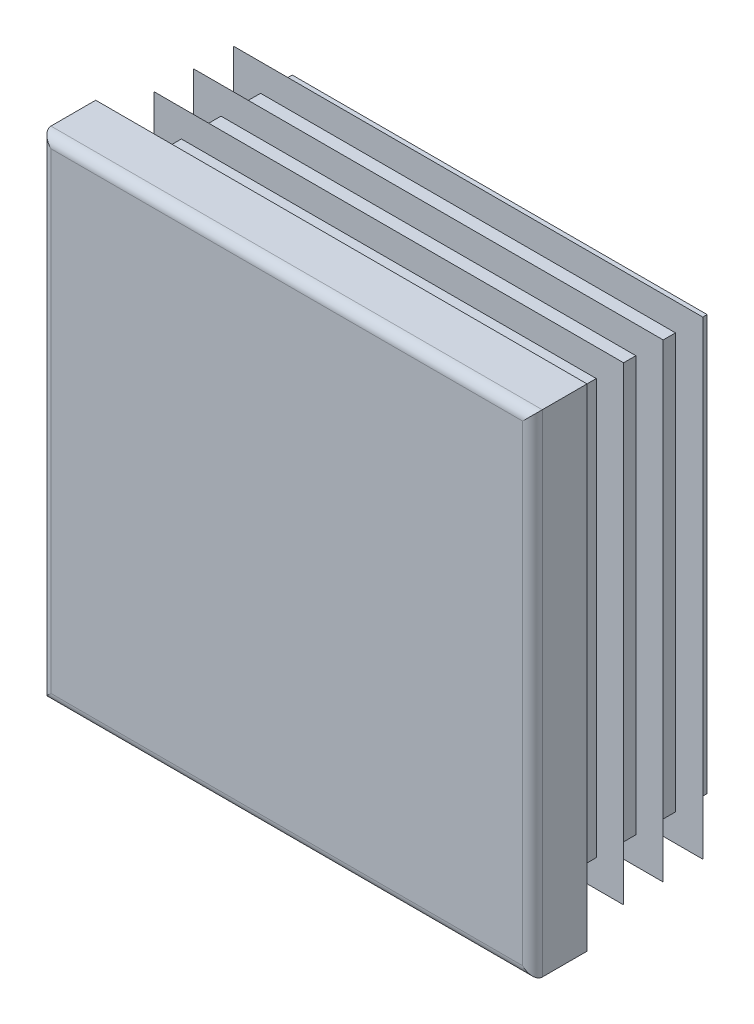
ISO-10303-21;
HEADER;
FILE_DESCRIPTION(('STEP AP214'),'2;1');
FILE_NAME('part.step','',(''),(''),'','','');
FILE_SCHEMA(('AUTOMOTIVE_DESIGN { 1 0 10303 214 1 1 1 1 }'));
ENDSEC;
DATA;
#1=APPLICATION_CONTEXT('core data for automotive mechanical design processes');
#2=APPLICATION_PROTOCOL_DEFINITION('international standard','automotive_design',2000,#1);
#3=PRODUCT_CONTEXT('',#1,'mechanical');
#4=PRODUCT('Part','Part','',(#3));
#5=PRODUCT_RELATED_PRODUCT_CATEGORY('part','',(#4));
#6=PRODUCT_DEFINITION_FORMATION('','',#4);
#7=PRODUCT_DEFINITION_CONTEXT('part definition',#1,'design');
#8=PRODUCT_DEFINITION('design','',#6,#7);
#9=PRODUCT_DEFINITION_SHAPE('','',#8);
#10=(LENGTH_UNIT() NAMED_UNIT(*) SI_UNIT(.MILLI.,.METRE.));
#11=(NAMED_UNIT(*) PLANE_ANGLE_UNIT() SI_UNIT($,.RADIAN.));
#12=(NAMED_UNIT(*) SI_UNIT($,.STERADIAN.) SOLID_ANGLE_UNIT());
#13=UNCERTAINTY_MEASURE_WITH_UNIT(LENGTH_MEASURE(1.E-05),#10,'distance_accuracy_value','');
#14=(GEOMETRIC_REPRESENTATION_CONTEXT(3) GLOBAL_UNCERTAINTY_ASSIGNED_CONTEXT((#13)) GLOBAL_UNIT_ASSIGNED_CONTEXT((#10,
#11,#12)) REPRESENTATION_CONTEXT('',''));
#15=CARTESIAN_POINT('',(0.,0.,0.));
#16=DIRECTION('',(0.,0.,1.));
#17=DIRECTION('',(1.,0.,0.));
#18=AXIS2_PLACEMENT_3D('',#15,#16,#17);
#19=CARTESIAN_POINT('',(21.6,-22.5,5.));
#20=DIRECTION('',(0.,0.,-1.));
#21=DIRECTION('',(0.,1.,0.));
#22=AXIS2_PLACEMENT_3D('',#19,#20,#21);
#23=PLANE('',#22);
#24=DIRECTION('',(0.,1.,0.));
#25=VECTOR('',#24,1.);
#26=CARTESIAN_POINT('',(-21.6,-22.5,5.));
#27=LINE('',#26,#25);
#28=CARTESIAN_POINT('',(-21.6,-21.6,5.));
#29=VERTEX_POINT('',#28);
#30=CARTESIAN_POINT('',(-21.6,21.6,5.));
#31=VERTEX_POINT('',#30);
#32=EDGE_CURVE('E262',#29,#31,#27,.T.);
#33=ORIENTED_EDGE('',*,*,#32,.F.);
#34=DIRECTION('',(-1.,0.,0.));
#35=VECTOR('',#34,1.);
#36=CARTESIAN_POINT('',(22.5,-21.6,5.));
#37=LINE('',#36,#35);
#38=CARTESIAN_POINT('',(21.6,-21.6,5.));
#39=VERTEX_POINT('',#38);
#40=EDGE_CURVE('E432',#39,#29,#37,.T.);
#41=ORIENTED_EDGE('',*,*,#40,.F.);
#42=DIRECTION('',(0.,1.,0.));
#43=VECTOR('',#42,1.);
#44=CARTESIAN_POINT('',(21.6,-22.5,5.));
#45=LINE('',#44,#43);
#46=CARTESIAN_POINT('',(21.6,21.6,5.));
#47=VERTEX_POINT('',#46);
#48=EDGE_CURVE('E257',#39,#47,#45,.T.);
#49=ORIENTED_EDGE('',*,*,#48,.T.);
#50=DIRECTION('',(-1.,0.,0.));
#51=VECTOR('',#50,1.);
#52=CARTESIAN_POINT('',(22.5,21.6,5.));
#53=LINE('',#52,#51);
#54=EDGE_CURVE('E534',#47,#31,#53,.T.);
#55=ORIENTED_EDGE('',*,*,#54,.T.);
#56=EDGE_LOOP('',(#33,#41,#49,#55));
#57=FACE_BOUND('',#56,.T.);
#58=ADVANCED_FACE('F14',(#57),#23,.F.);
#59=CARTESIAN_POINT('',(-21.6,-22.5,4.1));
#60=DIRECTION('',(0.,1.,0.));
#61=DIRECTION('',(-1.,0.,0.));
#62=AXIS2_PLACEMENT_3D('',#59,#60,#61);
#63=CYLINDRICAL_SURFACE('',#62,0.9);
#64=DIRECTION('',(0.,1.,0.));
#65=VECTOR('',#64,1.);
#66=CARTESIAN_POINT('',(-22.5,-22.5,4.1));
#67=LINE('',#66,#65);
#68=CARTESIAN_POINT('',(-22.5,-22.5,4.1));
#69=VERTEX_POINT('',#68);
#70=CARTESIAN_POINT('',(-22.5,22.5,4.1));
#71=VERTEX_POINT('',#70);
#72=EDGE_CURVE('E354',#69,#71,#67,.T.);
#73=ORIENTED_EDGE('',*,*,#72,.F.);
#74=CARTESIAN_POINT('',(-21.6,-21.6,4.1));
#75=DIRECTION('',(-0.707106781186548,0.707106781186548,0.));
#76=DIRECTION('',(0.707106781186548,0.707106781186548,0.));
#77=AXIS2_PLACEMENT_3D('',#74,#75,#76);
#78=ELLIPSE('',#77,1.27279220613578,0.9);
#79=EDGE_CURVE('E59',#69,#29,#78,.T.);
#80=ORIENTED_EDGE('',*,*,#79,.T.);
#81=ORIENTED_EDGE('',*,*,#32,.T.);
#82=CARTESIAN_POINT('',(-21.6,21.6,4.1));
#83=DIRECTION('',(0.707106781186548,0.707106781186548,0.));
#84=DIRECTION('',(-0.707106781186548,0.707106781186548,0.));
#85=AXIS2_PLACEMENT_3D('',#82,#83,#84);
#86=ELLIPSE('',#85,1.27279220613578,0.9);
#87=EDGE_CURVE('E258',#31,#71,#86,.F.);
#88=ORIENTED_EDGE('',*,*,#87,.T.);
#89=EDGE_LOOP('',(#73,#80,#81,#88));
#90=FACE_BOUND('',#89,.T.);
#91=ADVANCED_FACE('F16',(#90),#63,.T.);
#92=CARTESIAN_POINT('',(-22.5,-22.5,4.1));
#93=DIRECTION('',(1.,0.,0.));
#94=DIRECTION('',(0.,1.,0.));
#95=AXIS2_PLACEMENT_3D('',#92,#93,#94);
#96=PLANE('',#95);
#97=DIRECTION('',(0.,0.,-1.));
#98=VECTOR('',#97,1.);
#99=CARTESIAN_POINT('',(-22.5,22.5,4.1));
#100=LINE('',#99,#98);
#101=CARTESIAN_POINT('',(-22.5,22.5,0.));
#102=VERTEX_POINT('',#101);
#103=EDGE_CURVE('E519',#71,#102,#100,.T.);
#104=ORIENTED_EDGE('',*,*,#103,.T.);
#105=DIRECTION('',(0.,1.,0.));
#106=VECTOR('',#105,1.);
#107=CARTESIAN_POINT('',(-22.5,-22.5,0.));
#108=LINE('',#107,#106);
#109=CARTESIAN_POINT('',(-22.5,-22.5,0.));
#110=VERTEX_POINT('',#109);
#111=EDGE_CURVE('E352',#110,#102,#108,.T.);
#112=ORIENTED_EDGE('',*,*,#111,.F.);
#113=DIRECTION('',(0.,0.,-1.));
#114=VECTOR('',#113,1.);
#115=CARTESIAN_POINT('',(-22.5,-22.5,4.1));
#116=LINE('',#115,#114);
#117=EDGE_CURVE('E520',#69,#110,#116,.T.);
#118=ORIENTED_EDGE('',*,*,#117,.F.);
#119=ORIENTED_EDGE('',*,*,#72,.T.);
#120=EDGE_LOOP('',(#104,#112,#118,#119));
#121=FACE_BOUND('',#120,.T.);
#122=ADVANCED_FACE('F604',(#121),#96,.F.);
#123=CARTESIAN_POINT('',(-19.,-22.5,0.));
#124=DIRECTION('',(1.,0.,0.));
#125=DIRECTION('',(0.,1.,0.));
#126=AXIS2_PLACEMENT_3D('',#123,#124,#125);
#127=PLANE('',#126);
#128=DIRECTION('',(0.,1.,0.));
#129=VECTOR('',#128,1.);
#130=CARTESIAN_POINT('',(-19.,-22.5,0.));
#131=LINE('',#130,#129);
#132=CARTESIAN_POINT('',(-19.,-19.,0.));
#133=VERTEX_POINT('',#132);
#134=CARTESIAN_POINT('',(-19.,19.,0.));
#135=VERTEX_POINT('',#134);
#136=EDGE_CURVE('E349',#133,#135,#131,.T.);
#137=ORIENTED_EDGE('',*,*,#136,.T.);
#138=DIRECTION('',(0.,0.,-1.));
#139=VECTOR('',#138,1.);
#140=CARTESIAN_POINT('',(-19.,19.,0.));
#141=LINE('',#140,#139);
#142=CARTESIAN_POINT('',(-19.,19.,-0.725));
#143=VERTEX_POINT('',#142);
#144=EDGE_CURVE('E445',#135,#143,#141,.T.);
#145=ORIENTED_EDGE('',*,*,#144,.T.);
#146=DIRECTION('',(0.,1.,0.));
#147=VECTOR('',#146,1.);
#148=CARTESIAN_POINT('',(-19.,-22.5,-0.725));
#149=LINE('',#148,#147);
#150=CARTESIAN_POINT('',(-19.,-19.,-0.725));
#151=VERTEX_POINT('',#150);
#152=EDGE_CURVE('E346',#151,#143,#149,.T.);
#153=ORIENTED_EDGE('',*,*,#152,.F.);
#154=DIRECTION('',(0.,0.,1.));
#155=VECTOR('',#154,1.);
#156=CARTESIAN_POINT('',(-19.,-19.,0.));
#157=LINE('',#156,#155);
#158=EDGE_CURVE('E439',#151,#133,#157,.T.);
#159=ORIENTED_EDGE('',*,*,#158,.T.);
#160=EDGE_LOOP('',(#137,#145,#153,#159));
#161=FACE_BOUND('',#160,.T.);
#162=ADVANCED_FACE('F728',(#161),#127,.F.);
#163=CARTESIAN_POINT('',(-21.5,-22.5,-0.725));
#164=DIRECTION('',(0.573576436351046,0.,0.819152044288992));
#165=DIRECTION('',(-0.819152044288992,0.,0.573576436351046));
#166=AXIS2_PLACEMENT_3D('',#163,#164,#165);
#167=PLANE('',#166);
#168=DIRECTION('',(0.,1.,0.));
#169=VECTOR('',#168,1.);
#170=CARTESIAN_POINT('',(-21.5,-22.5,-0.725));
#171=LINE('',#170,#169);
#172=CARTESIAN_POINT('',(-21.5,-21.5,-0.725));
#173=VERTEX_POINT('',#172);
#174=CARTESIAN_POINT('',(-21.5,21.5,-0.725));
#175=VERTEX_POINT('',#174);
#176=EDGE_CURVE('E344',#173,#175,#171,.T.);
#177=ORIENTED_EDGE('',*,*,#176,.T.);
#178=DIRECTION('',(0.633687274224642,-0.633687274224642,-0.443712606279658));
#179=VECTOR('',#178,1.);
#180=CARTESIAN_POINT('',(-3.8313792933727,3.83137929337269,-13.0967014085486));
#181=LINE('',#180,#179);
#182=CARTESIAN_POINT('',(-19.,19.,-2.47551884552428));
#183=VERTEX_POINT('',#182);
#184=EDGE_CURVE('E457',#175,#183,#181,.T.);
#185=ORIENTED_EDGE('',*,*,#184,.T.);
#186=DIRECTION('',(0.,1.,0.));
#187=VECTOR('',#186,1.);
#188=CARTESIAN_POINT('',(-19.,-22.5,-2.47551884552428));
#189=LINE('',#188,#187);
#190=CARTESIAN_POINT('',(-19.,-19.,-2.47551884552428));
#191=VERTEX_POINT('',#190);
#192=EDGE_CURVE('E341',#191,#183,#189,.T.);
#193=ORIENTED_EDGE('',*,*,#192,.F.);
#194=DIRECTION('',(-0.633687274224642,-0.633687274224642,0.443712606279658));
#195=VECTOR('',#194,1.);
#196=CARTESIAN_POINT('',(-21.9015595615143,-21.9015595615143,-0.44382496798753));
#197=LINE('',#196,#195);
#198=EDGE_CURVE('E451',#191,#173,#197,.T.);
#199=ORIENTED_EDGE('',*,*,#198,.T.);
#200=EDGE_LOOP('',(#177,#185,#193,#199));
#201=FACE_BOUND('',#200,.T.);
#202=ADVANCED_FACE('F732',(#201),#167,.F.);
#203=CARTESIAN_POINT('',(-19.,-22.5,-2.47551884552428));
#204=DIRECTION('',(1.,0.,0.));
#205=DIRECTION('',(0.,1.,0.));
#206=AXIS2_PLACEMENT_3D('',#203,#204,#205);
#207=PLANE('',#206);
#208=ORIENTED_EDGE('',*,*,#192,.T.);
#209=DIRECTION('',(0.,0.,-1.));
#210=VECTOR('',#209,1.);
#211=CARTESIAN_POINT('',(-19.,19.,-2.47551884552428));
#212=LINE('',#211,#210);
#213=CARTESIAN_POINT('',(-19.,19.,-4.35));
#214=VERTEX_POINT('',#213);
#215=EDGE_CURVE('E463',#183,#214,#212,.T.);
#216=ORIENTED_EDGE('',*,*,#215,.T.);
#217=DIRECTION('',(0.,1.,0.));
#218=VECTOR('',#217,1.);
#219=CARTESIAN_POINT('',(-19.,-22.5,-4.35));
#220=LINE('',#219,#218);
#221=CARTESIAN_POINT('',(-19.,-19.,-4.35));
#222=VERTEX_POINT('',#221);
#223=EDGE_CURVE('E338',#222,#214,#220,.T.);
#224=ORIENTED_EDGE('',*,*,#223,.F.);
#225=DIRECTION('',(0.,0.,1.));
#226=VECTOR('',#225,1.);
#227=CARTESIAN_POINT('',(-19.,-19.,-2.47551884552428));
#228=LINE('',#227,#226);
#229=EDGE_CURVE('E460',#222,#191,#228,.T.);
#230=ORIENTED_EDGE('',*,*,#229,.T.);
#231=EDGE_LOOP('',(#208,#216,#224,#230));
#232=FACE_BOUND('',#231,.T.);
#233=ADVANCED_FACE('F738',(#232),#207,.F.);
#234=CARTESIAN_POINT('',(-21.5,-22.5,-4.35));
#235=DIRECTION('',(0.573576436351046,0.,0.819152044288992));
#236=DIRECTION('',(-0.819152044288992,0.,0.573576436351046));
#237=AXIS2_PLACEMENT_3D('',#234,#235,#236);
#238=PLANE('',#237);
#239=DIRECTION('',(0.,1.,0.));
#240=VECTOR('',#239,1.);
#241=CARTESIAN_POINT('',(-21.5,-22.5,-4.35));
#242=LINE('',#241,#240);
#243=CARTESIAN_POINT('',(-21.5,-21.5,-4.35));
#244=VERTEX_POINT('',#243);
#245=CARTESIAN_POINT('',(-21.5,21.5,-4.35));
#246=VERTEX_POINT('',#245);
#247=EDGE_CURVE('E336',#244,#246,#242,.T.);
#248=ORIENTED_EDGE('',*,*,#247,.T.);
#249=DIRECTION('',(0.633687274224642,-0.633687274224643,-0.443712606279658));
#250=VECTOR('',#249,1.);
#251=CARTESIAN_POINT('',(-3.8313792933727,3.83137929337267,-16.7217014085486));
#252=LINE('',#251,#250);
#253=CARTESIAN_POINT('',(-19.,19.,-6.10051884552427));
#254=VERTEX_POINT('',#253);
#255=EDGE_CURVE('E475',#246,#254,#252,.T.);
#256=ORIENTED_EDGE('',*,*,#255,.T.);
#257=DIRECTION('',(0.,1.,0.));
#258=VECTOR('',#257,1.);
#259=CARTESIAN_POINT('',(-19.,-22.5,-6.10051884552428));
#260=LINE('',#259,#258);
#261=CARTESIAN_POINT('',(-19.,-19.,-6.10051884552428));
#262=VERTEX_POINT('',#261);
#263=EDGE_CURVE('E333',#262,#254,#260,.T.);
#264=ORIENTED_EDGE('',*,*,#263,.F.);
#265=DIRECTION('',(-0.633687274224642,-0.633687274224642,0.443712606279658));
#266=VECTOR('',#265,1.);
#267=CARTESIAN_POINT('',(-21.9015595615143,-21.9015595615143,-4.06882496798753));
#268=LINE('',#267,#266);
#269=EDGE_CURVE('E469',#262,#244,#268,.T.);
#270=ORIENTED_EDGE('',*,*,#269,.T.);
#271=EDGE_LOOP('',(#248,#256,#264,#270));
#272=FACE_BOUND('',#271,.T.);
#273=ADVANCED_FACE('F742',(#272),#238,.F.);
#274=CARTESIAN_POINT('',(-19.,-22.5,-6.10051884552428));
#275=DIRECTION('',(1.,0.,0.));
#276=DIRECTION('',(0.,1.,0.));
#277=AXIS2_PLACEMENT_3D('',#274,#275,#276);
#278=PLANE('',#277);
#279=ORIENTED_EDGE('',*,*,#263,.T.);
#280=DIRECTION('',(0.,0.,-1.));
#281=VECTOR('',#280,1.);
#282=CARTESIAN_POINT('',(-19.,19.,-6.10051884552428));
#283=LINE('',#282,#281);
#284=CARTESIAN_POINT('',(-19.,19.,-7.975));
#285=VERTEX_POINT('',#284);
#286=EDGE_CURVE('E481',#254,#285,#283,.T.);
#287=ORIENTED_EDGE('',*,*,#286,.T.);
#288=DIRECTION('',(0.,1.,0.));
#289=VECTOR('',#288,1.);
#290=CARTESIAN_POINT('',(-19.,-22.5,-7.975));
#291=LINE('',#290,#289);
#292=CARTESIAN_POINT('',(-19.,-19.,-7.975));
#293=VERTEX_POINT('',#292);
#294=EDGE_CURVE('E330',#293,#285,#291,.T.);
#295=ORIENTED_EDGE('',*,*,#294,.F.);
#296=DIRECTION('',(0.,0.,1.));
#297=VECTOR('',#296,1.);
#298=CARTESIAN_POINT('',(-19.,-19.,-6.10051884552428));
#299=LINE('',#298,#297);
#300=EDGE_CURVE('E478',#293,#262,#299,.T.);
#301=ORIENTED_EDGE('',*,*,#300,.T.);
#302=EDGE_LOOP('',(#279,#287,#295,#301));
#303=FACE_BOUND('',#302,.T.);
#304=ADVANCED_FACE('F746',(#303),#278,.F.);
#305=CARTESIAN_POINT('',(-21.5,-22.5,-7.975));
#306=DIRECTION('',(0.573576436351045,0.,0.819152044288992));
#307=DIRECTION('',(-0.819152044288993,0.,0.573576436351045));
#308=AXIS2_PLACEMENT_3D('',#305,#306,#307);
#309=PLANE('',#308);
#310=DIRECTION('',(0.,1.,0.));
#311=VECTOR('',#310,1.);
#312=CARTESIAN_POINT('',(-21.5,-22.5,-7.975));
#313=LINE('',#312,#311);
#314=CARTESIAN_POINT('',(-21.5,-21.5,-7.975));
#315=VERTEX_POINT('',#314);
#316=CARTESIAN_POINT('',(-21.5,21.5,-7.975));
#317=VERTEX_POINT('',#316);
#318=EDGE_CURVE('E328',#315,#317,#313,.T.);
#319=ORIENTED_EDGE('',*,*,#318,.T.);
#320=DIRECTION('',(0.633687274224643,-0.633687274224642,-0.443712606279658));
#321=VECTOR('',#320,1.);
#322=CARTESIAN_POINT('',(-3.8313792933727,3.83137929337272,-20.3467014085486));
#323=LINE('',#322,#321);
#324=CARTESIAN_POINT('',(-19.,19.,-9.72551884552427));
#325=VERTEX_POINT('',#324);
#326=EDGE_CURVE('E493',#317,#325,#323,.T.);
#327=ORIENTED_EDGE('',*,*,#326,.T.);
#328=DIRECTION('',(0.,1.,0.));
#329=VECTOR('',#328,1.);
#330=CARTESIAN_POINT('',(-19.,-22.5,-9.72551884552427));
#331=LINE('',#330,#329);
#332=CARTESIAN_POINT('',(-19.,-19.,-9.72551884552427));
#333=VERTEX_POINT('',#332);
#334=EDGE_CURVE('E325',#333,#325,#331,.T.);
#335=ORIENTED_EDGE('',*,*,#334,.F.);
#336=DIRECTION('',(-0.633687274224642,-0.633687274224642,0.443712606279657));
#337=VECTOR('',#336,1.);
#338=CARTESIAN_POINT('',(-21.9015595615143,-21.9015595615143,-7.69382496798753));
#339=LINE('',#338,#337);
#340=EDGE_CURVE('E487',#333,#315,#339,.T.);
#341=ORIENTED_EDGE('',*,*,#340,.T.);
#342=EDGE_LOOP('',(#319,#327,#335,#341));
#343=FACE_BOUND('',#342,.T.);
#344=ADVANCED_FACE('F668',(#343),#309,.F.);
#345=CARTESIAN_POINT('',(-19.,-22.5,-9.72551884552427));
#346=DIRECTION('',(1.,0.,0.));
#347=DIRECTION('',(0.,1.,0.));
#348=AXIS2_PLACEMENT_3D('',#345,#346,#347);
#349=PLANE('',#348);
#350=ORIENTED_EDGE('',*,*,#334,.T.);
#351=DIRECTION('',(0.,0.,-1.));
#352=VECTOR('',#351,1.);
#353=CARTESIAN_POINT('',(-19.,19.,-9.72551884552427));
#354=LINE('',#353,#352);
#355=CARTESIAN_POINT('',(-19.,19.,-11.6));
#356=VERTEX_POINT('',#355);
#357=EDGE_CURVE('E499',#325,#356,#354,.T.);
#358=ORIENTED_EDGE('',*,*,#357,.T.);
#359=DIRECTION('',(0.,1.,0.));
#360=VECTOR('',#359,1.);
#361=CARTESIAN_POINT('',(-19.,-22.5,-11.6));
#362=LINE('',#361,#360);
#363=CARTESIAN_POINT('',(-19.,-19.,-11.6));
#364=VERTEX_POINT('',#363);
#365=EDGE_CURVE('E322',#364,#356,#362,.T.);
#366=ORIENTED_EDGE('',*,*,#365,.F.);
#367=DIRECTION('',(0.,0.,1.));
#368=VECTOR('',#367,1.);
#369=CARTESIAN_POINT('',(-19.,-19.,-9.72551884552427));
#370=LINE('',#369,#368);
#371=EDGE_CURVE('E496',#364,#333,#370,.T.);
#372=ORIENTED_EDGE('',*,*,#371,.T.);
#373=EDGE_LOOP('',(#350,#358,#366,#372));
#374=FACE_BOUND('',#373,.T.);
#375=ADVANCED_FACE('F665',(#374),#349,.F.);
#376=CARTESIAN_POINT('',(-21.5,-22.5,-11.6));
#377=DIRECTION('',(0.573576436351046,0.,0.819152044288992));
#378=DIRECTION('',(-0.819152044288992,0.,0.573576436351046));
#379=AXIS2_PLACEMENT_3D('',#376,#377,#378);
#380=PLANE('',#379);
#381=DIRECTION('',(0.,1.,0.));
#382=VECTOR('',#381,1.);
#383=CARTESIAN_POINT('',(-21.5,-22.5,-11.6));
#384=LINE('',#383,#382);
#385=CARTESIAN_POINT('',(-21.5,-21.5,-11.6));
#386=VERTEX_POINT('',#385);
#387=CARTESIAN_POINT('',(-21.5,21.5,-11.6));
#388=VERTEX_POINT('',#387);
#389=EDGE_CURVE('E320',#386,#388,#384,.T.);
#390=ORIENTED_EDGE('',*,*,#389,.T.);
#391=DIRECTION('',(0.633687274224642,-0.633687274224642,-0.443712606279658));
#392=VECTOR('',#391,1.);
#393=CARTESIAN_POINT('',(-3.83137929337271,3.8313792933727,-23.9717014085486));
#394=LINE('',#393,#392);
#395=CARTESIAN_POINT('',(-19.,19.,-13.3505188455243));
#396=VERTEX_POINT('',#395);
#397=EDGE_CURVE('E511',#388,#396,#394,.T.);
#398=ORIENTED_EDGE('',*,*,#397,.T.);
#399=DIRECTION('',(0.,1.,0.));
#400=VECTOR('',#399,1.);
#401=CARTESIAN_POINT('',(-19.,-22.5,-13.3505188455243));
#402=LINE('',#401,#400);
#403=CARTESIAN_POINT('',(-19.,-19.,-13.3505188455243));
#404=VERTEX_POINT('',#403);
#405=EDGE_CURVE('E317',#404,#396,#402,.T.);
#406=ORIENTED_EDGE('',*,*,#405,.F.);
#407=DIRECTION('',(-0.633687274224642,-0.633687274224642,0.443712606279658));
#408=VECTOR('',#407,1.);
#409=CARTESIAN_POINT('',(-21.9015595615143,-21.9015595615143,-11.3188249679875));
#410=LINE('',#409,#408);
#411=EDGE_CURVE('E505',#404,#386,#410,.T.);
#412=ORIENTED_EDGE('',*,*,#411,.T.);
#413=EDGE_LOOP('',(#390,#398,#406,#412));
#414=FACE_BOUND('',#413,.T.);
#415=ADVANCED_FACE('F580',(#414),#380,.F.);
#416=CARTESIAN_POINT('',(-19.,-22.5,-13.3505188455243));
#417=DIRECTION('',(1.,0.,0.));
#418=DIRECTION('',(0.,1.,0.));
#419=AXIS2_PLACEMENT_3D('',#416,#417,#418);
#420=PLANE('',#419);
#421=ORIENTED_EDGE('',*,*,#405,.T.);
#422=DIRECTION('',(0.,0.,-1.));
#423=VECTOR('',#422,1.);
#424=CARTESIAN_POINT('',(-19.,19.,-13.3505188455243));
#425=LINE('',#424,#423);
#426=CARTESIAN_POINT('',(-19.,19.,-14.5));
#427=VERTEX_POINT('',#426);
#428=EDGE_CURVE('E517',#396,#427,#425,.T.);
#429=ORIENTED_EDGE('',*,*,#428,.T.);
#430=DIRECTION('',(0.,1.,0.));
#431=VECTOR('',#430,1.);
#432=CARTESIAN_POINT('',(-19.,-22.5,-14.5));
#433=LINE('',#432,#431);
#434=CARTESIAN_POINT('',(-19.,-19.,-14.5));
#435=VERTEX_POINT('',#434);
#436=EDGE_CURVE('E314',#435,#427,#433,.T.);
#437=ORIENTED_EDGE('',*,*,#436,.F.);
#438=DIRECTION('',(0.,0.,1.));
#439=VECTOR('',#438,1.);
#440=CARTESIAN_POINT('',(-19.,-19.,-13.3505188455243));
#441=LINE('',#440,#439);
#442=EDGE_CURVE('E514',#435,#404,#441,.T.);
#443=ORIENTED_EDGE('',*,*,#442,.T.);
#444=EDGE_LOOP('',(#421,#429,#437,#443));
#445=FACE_BOUND('',#444,.T.);
#446=ADVANCED_FACE('F582',(#445),#420,.F.);
#447=CARTESIAN_POINT('',(-19.,-22.5,-14.5));
#448=DIRECTION('',(0.,0.,1.));
#449=DIRECTION('',(0.,-1.,0.));
#450=AXIS2_PLACEMENT_3D('',#447,#448,#449);
#451=PLANE('',#450);
#452=ORIENTED_EDGE('',*,*,#436,.T.);
#453=DIRECTION('',(-1.,0.,0.));
#454=VECTOR('',#453,1.);
#455=CARTESIAN_POINT('',(22.5,19.,-14.5));
#456=LINE('',#455,#454);
#457=CARTESIAN_POINT('',(19.,19.,-14.5));
#458=VERTEX_POINT('',#457);
#459=EDGE_CURVE('E388',#458,#427,#456,.T.);
#460=ORIENTED_EDGE('',*,*,#459,.F.);
#461=DIRECTION('',(0.,1.,0.));
#462=VECTOR('',#461,1.);
#463=CARTESIAN_POINT('',(19.,-22.5,-14.5));
#464=LINE('',#463,#462);
#465=CARTESIAN_POINT('',(19.,-19.,-14.5));
#466=VERTEX_POINT('',#465);
#467=EDGE_CURVE('E311',#466,#458,#464,.T.);
#468=ORIENTED_EDGE('',*,*,#467,.F.);
#469=DIRECTION('',(-1.,0.,0.));
#470=VECTOR('',#469,1.);
#471=CARTESIAN_POINT('',(22.5,-19.,-14.5));
#472=LINE('',#471,#470);
#473=EDGE_CURVE('E386',#466,#435,#472,.T.);
#474=ORIENTED_EDGE('',*,*,#473,.T.);
#475=EDGE_LOOP('',(#452,#460,#468,#474));
#476=FACE_BOUND('',#475,.T.);
#477=ADVANCED_FACE('F385',(#476),#451,.F.);
#478=CARTESIAN_POINT('',(19.,-22.5,-14.5));
#479=DIRECTION('',(-1.,0.,0.));
#480=DIRECTION('',(0.,-1.,0.));
#481=AXIS2_PLACEMENT_3D('',#478,#479,#480);
#482=PLANE('',#481);
#483=ORIENTED_EDGE('',*,*,#467,.T.);
#484=DIRECTION('',(0.,0.,1.));
#485=VECTOR('',#484,1.);
#486=CARTESIAN_POINT('',(19.,19.,-14.5));
#487=LINE('',#486,#485);
#488=CARTESIAN_POINT('',(19.,19.,-13.3505188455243));
#489=VERTEX_POINT('',#488);
#490=EDGE_CURVE('E9',#458,#489,#487,.T.);
#491=ORIENTED_EDGE('',*,*,#490,.T.);
#492=DIRECTION('',(0.,1.,0.));
#493=VECTOR('',#492,1.);
#494=CARTESIAN_POINT('',(19.,-22.5,-13.3505188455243));
#495=LINE('',#494,#493);
#496=CARTESIAN_POINT('',(19.,-19.,-13.3505188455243));
#497=VERTEX_POINT('',#496);
#498=EDGE_CURVE('E308',#497,#489,#495,.T.);
#499=ORIENTED_EDGE('',*,*,#498,.F.);
#500=DIRECTION('',(0.,0.,-1.));
#501=VECTOR('',#500,1.);
#502=CARTESIAN_POINT('',(19.,-19.,-14.5));
#503=LINE('',#502,#501);
#504=EDGE_CURVE('E23',#497,#466,#503,.T.);
#505=ORIENTED_EDGE('',*,*,#504,.T.);
#506=EDGE_LOOP('',(#483,#491,#499,#505));
#507=FACE_BOUND('',#506,.T.);
#508=ADVANCED_FACE('F378',(#507),#482,.F.);
#509=CARTESIAN_POINT('',(19.,-22.5,-13.3505188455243));
#510=DIRECTION('',(-0.573576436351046,0.,0.819152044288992));
#511=DIRECTION('',(-0.819152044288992,0.,-0.573576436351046));
#512=AXIS2_PLACEMENT_3D('',#509,#510,#511);
#513=PLANE('',#512);
#514=ORIENTED_EDGE('',*,*,#498,.T.);
#515=DIRECTION('',(0.633687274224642,0.633687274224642,0.443712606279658));
#516=VECTOR('',#515,1.);
#517=CARTESIAN_POINT('',(2.33527819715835,2.33527819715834,-25.0192826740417));
#518=LINE('',#517,#516);
#519=CARTESIAN_POINT('',(21.5,21.5,-11.6));
#520=VERTEX_POINT('',#519);
#521=EDGE_CURVE('E508',#489,#520,#518,.T.);
#522=ORIENTED_EDGE('',*,*,#521,.T.);
#523=DIRECTION('',(0.,1.,0.));
#524=VECTOR('',#523,1.);
#525=CARTESIAN_POINT('',(21.5,-22.5,-11.6));
#526=LINE('',#525,#524);
#527=CARTESIAN_POINT('',(21.5,-21.5,-11.6));
#528=VERTEX_POINT('',#527);
#529=EDGE_CURVE('E305',#528,#520,#526,.T.);
#530=ORIENTED_EDGE('',*,*,#529,.F.);
#531=DIRECTION('',(-0.633687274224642,0.633687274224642,-0.443712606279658));
#532=VECTOR('',#531,1.);
#533=CARTESIAN_POINT('',(20.4054584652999,-20.4054584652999,-12.3664062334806));
#534=LINE('',#533,#532);
#535=EDGE_CURVE('E502',#528,#497,#534,.T.);
#536=ORIENTED_EDGE('',*,*,#535,.T.);
#537=EDGE_LOOP('',(#514,#522,#530,#536));
#538=FACE_BOUND('',#537,.T.);
#539=ADVANCED_FACE('F588',(#538),#513,.F.);
#540=CARTESIAN_POINT('',(21.5,-22.5,-11.6));
#541=DIRECTION('',(0.,0.,-1.));
#542=DIRECTION('',(0.,1.,0.));
#543=AXIS2_PLACEMENT_3D('',#540,#541,#542);
#544=PLANE('',#543);
#545=ORIENTED_EDGE('',*,*,#529,.T.);
#546=DIRECTION('',(-1.,0.,0.));
#547=VECTOR('',#546,1.);
#548=CARTESIAN_POINT('',(22.5,21.5,-11.6));
#549=LINE('',#548,#547);
#550=EDGE_CURVE('E394',#520,#388,#549,.T.);
#551=ORIENTED_EDGE('',*,*,#550,.T.);
#552=ORIENTED_EDGE('',*,*,#389,.F.);
#553=DIRECTION('',(-1.,0.,0.));
#554=VECTOR('',#553,1.);
#555=CARTESIAN_POINT('',(22.5,-21.5,-11.6));
#556=LINE('',#555,#554);
#557=EDGE_CURVE('E401',#528,#386,#556,.T.);
#558=ORIENTED_EDGE('',*,*,#557,.F.);
#559=EDGE_LOOP('',(#545,#551,#552,#558));
#560=FACE_BOUND('',#559,.T.);
#561=ORIENTED_EDGE('',*,*,#365,.T.);
#562=DIRECTION('',(-1.,0.,0.));
#563=VECTOR('',#562,1.);
#564=CARTESIAN_POINT('',(22.5,19.,-11.6));
#565=LINE('',#564,#563);
#566=CARTESIAN_POINT('',(19.,19.,-11.6));
#567=VERTEX_POINT('',#566);
#568=EDGE_CURVE('E567',#567,#356,#565,.T.);
#569=ORIENTED_EDGE('',*,*,#568,.F.);
#570=DIRECTION('',(0.,1.,0.));
#571=VECTOR('',#570,1.);
#572=CARTESIAN_POINT('',(19.,-22.5,-11.6));
#573=LINE('',#572,#571);
#574=CARTESIAN_POINT('',(19.,-19.,-11.6));
#575=VERTEX_POINT('',#574);
#576=EDGE_CURVE('E302',#575,#567,#573,.T.);
#577=ORIENTED_EDGE('',*,*,#576,.F.);
#578=DIRECTION('',(-1.,0.,0.));
#579=VECTOR('',#578,1.);
#580=CARTESIAN_POINT('',(22.5,-19.,-11.6));
#581=LINE('',#580,#579);
#582=EDGE_CURVE('E403',#575,#364,#581,.T.);
#583=ORIENTED_EDGE('',*,*,#582,.T.);
#584=EDGE_LOOP('',(#561,#569,#577,#583));
#585=FACE_BOUND('',#584,.T.);
#586=ADVANCED_FACE('F571',(#560,#585),#544,.F.);
#587=CARTESIAN_POINT('',(19.,-22.5,-11.6));
#588=DIRECTION('',(-1.,0.,0.));
#589=DIRECTION('',(0.,-1.,0.));
#590=AXIS2_PLACEMENT_3D('',#587,#588,#589);
#591=PLANE('',#590);
#592=ORIENTED_EDGE('',*,*,#576,.T.);
#593=DIRECTION('',(0.,0.,1.));
#594=VECTOR('',#593,1.);
#595=CARTESIAN_POINT('',(19.,19.,-11.6));
#596=LINE('',#595,#594);
#597=CARTESIAN_POINT('',(19.,19.,-9.72551884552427));
#598=VERTEX_POINT('',#597);
#599=EDGE_CURVE('E372',#567,#598,#596,.T.);
#600=ORIENTED_EDGE('',*,*,#599,.T.);
#601=DIRECTION('',(0.,1.,0.));
#602=VECTOR('',#601,1.);
#603=CARTESIAN_POINT('',(19.,-22.5,-9.72551884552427));
#604=LINE('',#603,#602);
#605=CARTESIAN_POINT('',(19.,-19.,-9.72551884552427));
#606=VERTEX_POINT('',#605);
#607=EDGE_CURVE('E299',#606,#598,#604,.T.);
#608=ORIENTED_EDGE('',*,*,#607,.F.);
#609=DIRECTION('',(0.,0.,-1.));
#610=VECTOR('',#609,1.);
#611=CARTESIAN_POINT('',(19.,-19.,-11.6));
#612=LINE('',#611,#610);
#613=EDGE_CURVE('E369',#606,#575,#612,.T.);
#614=ORIENTED_EDGE('',*,*,#613,.T.);
#615=EDGE_LOOP('',(#592,#600,#608,#614));
#616=FACE_BOUND('',#615,.T.);
#617=ADVANCED_FACE('F596',(#616),#591,.F.);
#618=CARTESIAN_POINT('',(19.,-22.5,-9.72551884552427));
#619=DIRECTION('',(-0.573576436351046,0.,0.819152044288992));
#620=DIRECTION('',(-0.819152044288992,0.,-0.573576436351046));
#621=AXIS2_PLACEMENT_3D('',#618,#619,#620);
#622=PLANE('',#621);
#623=ORIENTED_EDGE('',*,*,#607,.T.);
#624=DIRECTION('',(0.633687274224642,0.633687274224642,0.443712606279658));
#625=VECTOR('',#624,1.);
#626=CARTESIAN_POINT('',(2.33527819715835,2.33527819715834,-21.3942826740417));
#627=LINE('',#626,#625);
#628=CARTESIAN_POINT('',(21.5,21.5,-7.975));
#629=VERTEX_POINT('',#628);
#630=EDGE_CURVE('E490',#598,#629,#627,.T.);
#631=ORIENTED_EDGE('',*,*,#630,.T.);
#632=DIRECTION('',(0.,1.,0.));
#633=VECTOR('',#632,1.);
#634=CARTESIAN_POINT('',(21.5,-22.5,-7.975));
#635=LINE('',#634,#633);
#636=CARTESIAN_POINT('',(21.5,-21.5,-7.975));
#637=VERTEX_POINT('',#636);
#638=EDGE_CURVE('E296',#637,#629,#635,.T.);
#639=ORIENTED_EDGE('',*,*,#638,.F.);
#640=DIRECTION('',(-0.633687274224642,0.633687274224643,-0.443712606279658));
#641=VECTOR('',#640,1.);
#642=CARTESIAN_POINT('',(20.4054584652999,-20.4054584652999,-8.74140623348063));
#643=LINE('',#642,#641);
#644=EDGE_CURVE('E484',#637,#606,#643,.T.);
#645=ORIENTED_EDGE('',*,*,#644,.T.);
#646=EDGE_LOOP('',(#623,#631,#639,#645));
#647=FACE_BOUND('',#646,.T.);
#648=ADVANCED_FACE('F648',(#647),#622,.F.);
#649=CARTESIAN_POINT('',(21.5,-22.5,-7.975));
#650=DIRECTION('',(0.,0.,-1.));
#651=DIRECTION('',(0.,1.,0.));
#652=AXIS2_PLACEMENT_3D('',#649,#650,#651);
#653=PLANE('',#652);
#654=ORIENTED_EDGE('',*,*,#638,.T.);
#655=DIRECTION('',(-1.,0.,0.));
#656=VECTOR('',#655,1.);
#657=CARTESIAN_POINT('',(22.5,21.5,-7.975));
#658=LINE('',#657,#656);
#659=EDGE_CURVE('E561',#629,#317,#658,.T.);
#660=ORIENTED_EDGE('',*,*,#659,.T.);
#661=ORIENTED_EDGE('',*,*,#318,.F.);
#662=DIRECTION('',(-1.,0.,0.));
#663=VECTOR('',#662,1.);
#664=CARTESIAN_POINT('',(22.5,-21.5,-7.975));
#665=LINE('',#664,#663);
#666=EDGE_CURVE('E409',#637,#315,#665,.T.);
#667=ORIENTED_EDGE('',*,*,#666,.F.);
#668=EDGE_LOOP('',(#654,#660,#661,#667));
#669=FACE_BOUND('',#668,.T.);
#670=ORIENTED_EDGE('',*,*,#294,.T.);
#671=DIRECTION('',(-1.,0.,0.));
#672=VECTOR('',#671,1.);
#673=CARTESIAN_POINT('',(22.5,19.,-7.975));
#674=LINE('',#673,#672);
#675=CARTESIAN_POINT('',(19.,19.,-7.975));
#676=VERTEX_POINT('',#675);
#677=EDGE_CURVE('E559',#676,#285,#674,.T.);
#678=ORIENTED_EDGE('',*,*,#677,.F.);
#679=DIRECTION('',(0.,1.,0.));
#680=VECTOR('',#679,1.);
#681=CARTESIAN_POINT('',(19.,-22.5,-7.975));
#682=LINE('',#681,#680);
#683=CARTESIAN_POINT('',(19.,-19.,-7.975));
#684=VERTEX_POINT('',#683);
#685=EDGE_CURVE('E293',#684,#676,#682,.T.);
#686=ORIENTED_EDGE('',*,*,#685,.F.);
#687=DIRECTION('',(-1.,0.,0.));
#688=VECTOR('',#687,1.);
#689=CARTESIAN_POINT('',(22.5,-19.,-7.975));
#690=LINE('',#689,#688);
#691=EDGE_CURVE('E411',#684,#293,#690,.T.);
#692=ORIENTED_EDGE('',*,*,#691,.T.);
#693=EDGE_LOOP('',(#670,#678,#686,#692));
#694=FACE_BOUND('',#693,.T.);
#695=ADVANCED_FACE('F644',(#669,#694),#653,.F.);
#696=CARTESIAN_POINT('',(19.,-22.5,-7.975));
#697=DIRECTION('',(-1.,0.,0.));
#698=DIRECTION('',(0.,-1.,0.));
#699=AXIS2_PLACEMENT_3D('',#696,#697,#698);
#700=PLANE('',#699);
#701=ORIENTED_EDGE('',*,*,#685,.T.);
#702=DIRECTION('',(0.,0.,1.));
#703=VECTOR('',#702,1.);
#704=CARTESIAN_POINT('',(19.,19.,-7.975));
#705=LINE('',#704,#703);
#706=CARTESIAN_POINT('',(19.,19.,-6.10051884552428));
#707=VERTEX_POINT('',#706);
#708=EDGE_CURVE('E366',#676,#707,#705,.T.);
#709=ORIENTED_EDGE('',*,*,#708,.T.);
#710=DIRECTION('',(0.,1.,0.));
#711=VECTOR('',#710,1.);
#712=CARTESIAN_POINT('',(19.,-22.5,-6.10051884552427));
#713=LINE('',#712,#711);
#714=CARTESIAN_POINT('',(19.,-19.,-6.10051884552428));
#715=VERTEX_POINT('',#714);
#716=EDGE_CURVE('E290',#715,#707,#713,.T.);
#717=ORIENTED_EDGE('',*,*,#716,.F.);
#718=DIRECTION('',(0.,0.,-1.));
#719=VECTOR('',#718,1.);
#720=CARTESIAN_POINT('',(19.,-19.,-7.975));
#721=LINE('',#720,#719);
#722=EDGE_CURVE('E363',#715,#684,#721,.T.);
#723=ORIENTED_EDGE('',*,*,#722,.T.);
#724=EDGE_LOOP('',(#701,#709,#717,#723));
#725=FACE_BOUND('',#724,.T.);
#726=ADVANCED_FACE('F640',(#725),#700,.F.);
#727=CARTESIAN_POINT('',(19.,-22.5,-6.10051884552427));
#728=DIRECTION('',(-0.573576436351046,0.,0.819152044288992));
#729=DIRECTION('',(-0.819152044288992,0.,-0.573576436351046));
#730=AXIS2_PLACEMENT_3D('',#727,#728,#729);
#731=PLANE('',#730);
#732=ORIENTED_EDGE('',*,*,#716,.T.);
#733=DIRECTION('',(0.633687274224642,0.633687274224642,0.443712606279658));
#734=VECTOR('',#733,1.);
#735=CARTESIAN_POINT('',(2.33527819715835,2.33527819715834,-17.7692826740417));
#736=LINE('',#735,#734);
#737=CARTESIAN_POINT('',(21.5,21.5,-4.35));
#738=VERTEX_POINT('',#737);
#739=EDGE_CURVE('E472',#707,#738,#736,.T.);
#740=ORIENTED_EDGE('',*,*,#739,.T.);
#741=DIRECTION('',(0.,1.,0.));
#742=VECTOR('',#741,1.);
#743=CARTESIAN_POINT('',(21.5,-22.5,-4.35));
#744=LINE('',#743,#742);
#745=CARTESIAN_POINT('',(21.5,-21.5,-4.35));
#746=VERTEX_POINT('',#745);
#747=EDGE_CURVE('E287',#746,#738,#744,.T.);
#748=ORIENTED_EDGE('',*,*,#747,.F.);
#749=DIRECTION('',(-0.633687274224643,0.633687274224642,-0.443712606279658));
#750=VECTOR('',#749,1.);
#751=CARTESIAN_POINT('',(20.4054584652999,-20.4054584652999,-5.11640623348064));
#752=LINE('',#751,#750);
#753=EDGE_CURVE('E466',#746,#715,#752,.T.);
#754=ORIENTED_EDGE('',*,*,#753,.T.);
#755=EDGE_LOOP('',(#732,#740,#748,#754));
#756=FACE_BOUND('',#755,.T.);
#757=ADVANCED_FACE('F636',(#756),#731,.F.);
#758=CARTESIAN_POINT('',(21.5,-22.5,-4.35));
#759=DIRECTION('',(0.,0.,-1.));
#760=DIRECTION('',(0.,1.,0.));
#761=AXIS2_PLACEMENT_3D('',#758,#759,#760);
#762=PLANE('',#761);
#763=ORIENTED_EDGE('',*,*,#747,.T.);
#764=DIRECTION('',(-1.,0.,0.));
#765=VECTOR('',#764,1.);
#766=CARTESIAN_POINT('',(22.5,21.5,-4.35));
#767=LINE('',#766,#765);
#768=EDGE_CURVE('E553',#738,#246,#767,.T.);
#769=ORIENTED_EDGE('',*,*,#768,.T.);
#770=ORIENTED_EDGE('',*,*,#247,.F.);
#771=DIRECTION('',(-1.,0.,0.));
#772=VECTOR('',#771,1.);
#773=CARTESIAN_POINT('',(22.5,-21.5,-4.35));
#774=LINE('',#773,#772);
#775=EDGE_CURVE('E417',#746,#244,#774,.T.);
#776=ORIENTED_EDGE('',*,*,#775,.F.);
#777=EDGE_LOOP('',(#763,#769,#770,#776));
#778=FACE_BOUND('',#777,.T.);
#779=ORIENTED_EDGE('',*,*,#223,.T.);
#780=DIRECTION('',(-1.,0.,0.));
#781=VECTOR('',#780,1.);
#782=CARTESIAN_POINT('',(22.5,19.,-4.35));
#783=LINE('',#782,#781);
#784=CARTESIAN_POINT('',(19.,19.,-4.35));
#785=VERTEX_POINT('',#784);
#786=EDGE_CURVE('E551',#785,#214,#783,.T.);
#787=ORIENTED_EDGE('',*,*,#786,.F.);
#788=DIRECTION('',(0.,1.,0.));
#789=VECTOR('',#788,1.);
#790=CARTESIAN_POINT('',(19.,-22.5,-4.35));
#791=LINE('',#790,#789);
#792=CARTESIAN_POINT('',(19.,-19.,-4.35));
#793=VERTEX_POINT('',#792);
#794=EDGE_CURVE('E284',#793,#785,#791,.T.);
#795=ORIENTED_EDGE('',*,*,#794,.F.);
#796=DIRECTION('',(-1.,0.,0.));
#797=VECTOR('',#796,1.);
#798=CARTESIAN_POINT('',(22.5,-19.,-4.35));
#799=LINE('',#798,#797);
#800=EDGE_CURVE('E419',#793,#222,#799,.T.);
#801=ORIENTED_EDGE('',*,*,#800,.T.);
#802=EDGE_LOOP('',(#779,#787,#795,#801));
#803=FACE_BOUND('',#802,.T.);
#804=ADVANCED_FACE('F632',(#778,#803),#762,.F.);
#805=CARTESIAN_POINT('',(19.,-22.5,-4.35));
#806=DIRECTION('',(-1.,0.,0.));
#807=DIRECTION('',(0.,-1.,0.));
#808=AXIS2_PLACEMENT_3D('',#805,#806,#807);
#809=PLANE('',#808);
#810=ORIENTED_EDGE('',*,*,#794,.T.);
#811=DIRECTION('',(0.,0.,1.));
#812=VECTOR('',#811,1.);
#813=CARTESIAN_POINT('',(19.,19.,-4.35));
#814=LINE('',#813,#812);
#815=CARTESIAN_POINT('',(19.,19.,-2.47551884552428));
#816=VERTEX_POINT('',#815);
#817=EDGE_CURVE('E360',#785,#816,#814,.T.);
#818=ORIENTED_EDGE('',*,*,#817,.T.);
#819=DIRECTION('',(0.,1.,0.));
#820=VECTOR('',#819,1.);
#821=CARTESIAN_POINT('',(19.,-22.5,-2.47551884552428));
#822=LINE('',#821,#820);
#823=CARTESIAN_POINT('',(19.,-19.,-2.47551884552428));
#824=VERTEX_POINT('',#823);
#825=EDGE_CURVE('E281',#824,#816,#822,.T.);
#826=ORIENTED_EDGE('',*,*,#825,.F.);
#827=DIRECTION('',(0.,0.,-1.));
#828=VECTOR('',#827,1.);
#829=CARTESIAN_POINT('',(19.,-19.,-4.35));
#830=LINE('',#829,#828);
#831=EDGE_CURVE('E357',#824,#793,#830,.T.);
#832=ORIENTED_EDGE('',*,*,#831,.T.);
#833=EDGE_LOOP('',(#810,#818,#826,#832));
#834=FACE_BOUND('',#833,.T.);
#835=ADVANCED_FACE('F628',(#834),#809,.F.);
#836=CARTESIAN_POINT('',(19.,-22.5,-2.47551884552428));
#837=DIRECTION('',(-0.573576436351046,0.,0.819152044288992));
#838=DIRECTION('',(-0.819152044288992,0.,-0.573576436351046));
#839=AXIS2_PLACEMENT_3D('',#836,#837,#838);
#840=PLANE('',#839);
#841=ORIENTED_EDGE('',*,*,#825,.T.);
#842=DIRECTION('',(0.633687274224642,0.633687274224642,0.443712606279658));
#843=VECTOR('',#842,1.);
#844=CARTESIAN_POINT('',(2.33527819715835,2.33527819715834,-14.1442826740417));
#845=LINE('',#844,#843);
#846=CARTESIAN_POINT('',(21.5,21.5,-0.725));
#847=VERTEX_POINT('',#846);
#848=EDGE_CURVE('E454',#816,#847,#845,.T.);
#849=ORIENTED_EDGE('',*,*,#848,.T.);
#850=DIRECTION('',(0.,1.,0.));
#851=VECTOR('',#850,1.);
#852=CARTESIAN_POINT('',(21.5,-22.5,-0.725));
#853=LINE('',#852,#851);
#854=CARTESIAN_POINT('',(21.5,-21.5,-0.725));
#855=VERTEX_POINT('',#854);
#856=EDGE_CURVE('E278',#855,#847,#853,.T.);
#857=ORIENTED_EDGE('',*,*,#856,.F.);
#858=DIRECTION('',(-0.633687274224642,0.633687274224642,-0.443712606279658));
#859=VECTOR('',#858,1.);
#860=CARTESIAN_POINT('',(20.4054584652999,-20.4054584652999,-1.49140623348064));
#861=LINE('',#860,#859);
#862=EDGE_CURVE('E448',#855,#824,#861,.T.);
#863=ORIENTED_EDGE('',*,*,#862,.T.);
#864=EDGE_LOOP('',(#841,#849,#857,#863));
#865=FACE_BOUND('',#864,.T.);
#866=ADVANCED_FACE('F624',(#865),#840,.F.);
#867=CARTESIAN_POINT('',(21.5,-22.5,-0.725));
#868=DIRECTION('',(0.,0.,-1.));
#869=DIRECTION('',(0.,1.,0.));
#870=AXIS2_PLACEMENT_3D('',#867,#868,#869);
#871=PLANE('',#870);
#872=ORIENTED_EDGE('',*,*,#856,.T.);
#873=DIRECTION('',(-1.,0.,0.));
#874=VECTOR('',#873,1.);
#875=CARTESIAN_POINT('',(22.5,21.5,-0.725));
#876=LINE('',#875,#874);
#877=EDGE_CURVE('E545',#847,#175,#876,.T.);
#878=ORIENTED_EDGE('',*,*,#877,.T.);
#879=ORIENTED_EDGE('',*,*,#176,.F.);
#880=DIRECTION('',(-1.,0.,0.));
#881=VECTOR('',#880,1.);
#882=CARTESIAN_POINT('',(22.5,-21.5,-0.725));
#883=LINE('',#882,#881);
#884=EDGE_CURVE('E425',#855,#173,#883,.T.);
#885=ORIENTED_EDGE('',*,*,#884,.F.);
#886=EDGE_LOOP('',(#872,#878,#879,#885));
#887=FACE_BOUND('',#886,.T.);
#888=ORIENTED_EDGE('',*,*,#152,.T.);
#889=DIRECTION('',(-1.,0.,0.));
#890=VECTOR('',#889,1.);
#891=CARTESIAN_POINT('',(22.5,19.,-0.725));
#892=LINE('',#891,#890);
#893=CARTESIAN_POINT('',(19.,19.,-0.725));
#894=VERTEX_POINT('',#893);
#895=EDGE_CURVE('E543',#894,#143,#892,.T.);
#896=ORIENTED_EDGE('',*,*,#895,.F.);
#897=DIRECTION('',(0.,1.,0.));
#898=VECTOR('',#897,1.);
#899=CARTESIAN_POINT('',(19.,-22.5,-0.725));
#900=LINE('',#899,#898);
#901=CARTESIAN_POINT('',(19.,-19.,-0.725));
#902=VERTEX_POINT('',#901);
#903=EDGE_CURVE('E275',#902,#894,#900,.T.);
#904=ORIENTED_EDGE('',*,*,#903,.F.);
#905=DIRECTION('',(-1.,0.,0.));
#906=VECTOR('',#905,1.);
#907=CARTESIAN_POINT('',(22.5,-19.,-0.725));
#908=LINE('',#907,#906);
#909=EDGE_CURVE('E427',#902,#151,#908,.T.);
#910=ORIENTED_EDGE('',*,*,#909,.T.);
#911=EDGE_LOOP('',(#888,#896,#904,#910));
#912=FACE_BOUND('',#911,.T.);
#913=ADVANCED_FACE('F620',(#887,#912),#871,.F.);
#914=CARTESIAN_POINT('',(19.,-22.5,-0.725));
#915=DIRECTION('',(-1.,0.,0.));
#916=DIRECTION('',(0.,-1.,0.));
#917=AXIS2_PLACEMENT_3D('',#914,#915,#916);
#918=PLANE('',#917);
#919=ORIENTED_EDGE('',*,*,#903,.T.);
#920=DIRECTION('',(0.,0.,1.));
#921=VECTOR('',#920,1.);
#922=CARTESIAN_POINT('',(19.,19.,-0.725));
#923=LINE('',#922,#921);
#924=CARTESIAN_POINT('',(19.,19.,0.));
#925=VERTEX_POINT('',#924);
#926=EDGE_CURVE('E442',#894,#925,#923,.T.);
#927=ORIENTED_EDGE('',*,*,#926,.T.);
#928=DIRECTION('',(0.,1.,0.));
#929=VECTOR('',#928,1.);
#930=CARTESIAN_POINT('',(19.,-22.5,0.));
#931=LINE('',#930,#929);
#932=CARTESIAN_POINT('',(19.,-19.,0.));
#933=VERTEX_POINT('',#932);
#934=EDGE_CURVE('E268',#933,#925,#931,.T.);
#935=ORIENTED_EDGE('',*,*,#934,.F.);
#936=DIRECTION('',(0.,0.,-1.));
#937=VECTOR('',#936,1.);
#938=CARTESIAN_POINT('',(19.,-19.,-0.725));
#939=LINE('',#938,#937);
#940=EDGE_CURVE('E436',#933,#902,#939,.T.);
#941=ORIENTED_EDGE('',*,*,#940,.T.);
#942=EDGE_LOOP('',(#919,#927,#935,#941));
#943=FACE_BOUND('',#942,.T.);
#944=ADVANCED_FACE('F616',(#943),#918,.F.);
#945=CARTESIAN_POINT('',(19.,-22.5,0.));
#946=DIRECTION('',(0.,0.,1.));
#947=DIRECTION('',(-1.,0.,0.));
#948=AXIS2_PLACEMENT_3D('',#945,#946,#947);
#949=PLANE('',#948);
#950=DIRECTION('',(-1.,0.,0.));
#951=VECTOR('',#950,1.);
#952=CARTESIAN_POINT('',(22.5,19.,0.));
#953=LINE('',#952,#951);
#954=EDGE_CURVE('E538',#925,#135,#953,.T.);
#955=ORIENTED_EDGE('',*,*,#954,.T.);
#956=ORIENTED_EDGE('',*,*,#136,.F.);
#957=DIRECTION('',(-1.,0.,0.));
#958=VECTOR('',#957,1.);
#959=CARTESIAN_POINT('',(22.5,-19.,0.));
#960=LINE('',#959,#958);
#961=EDGE_CURVE('E248',#933,#133,#960,.T.);
#962=ORIENTED_EDGE('',*,*,#961,.F.);
#963=ORIENTED_EDGE('',*,*,#934,.T.);
#964=EDGE_LOOP('',(#955,#956,#962,#963));
#965=FACE_BOUND('',#964,.T.);
#966=ORIENTED_EDGE('',*,*,#111,.T.);
#967=DIRECTION('',(1.,0.,0.));
#968=VECTOR('',#967,1.);
#969=CARTESIAN_POINT('',(19.,22.5,0.));
#970=LINE('',#969,#968);
#971=CARTESIAN_POINT('',(22.5,22.5,0.));
#972=VERTEX_POINT('',#971);
#973=EDGE_CURVE('E525',#102,#972,#970,.T.);
#974=ORIENTED_EDGE('',*,*,#973,.T.);
#975=DIRECTION('',(0.,1.,0.));
#976=VECTOR('',#975,1.);
#977=CARTESIAN_POINT('',(22.5,-22.5,0.));
#978=LINE('',#977,#976);
#979=CARTESIAN_POINT('',(22.5,-22.5,0.));
#980=VERTEX_POINT('',#979);
#981=EDGE_CURVE('E45',#980,#972,#978,.T.);
#982=ORIENTED_EDGE('',*,*,#981,.F.);
#983=DIRECTION('',(1.,0.,0.));
#984=VECTOR('',#983,1.);
#985=CARTESIAN_POINT('',(-22.5,-22.5,0.));
#986=LINE('',#985,#984);
#987=EDGE_CURVE('E31',#110,#980,#986,.T.);
#988=ORIENTED_EDGE('',*,*,#987,.F.);
#989=EDGE_LOOP('',(#966,#974,#982,#988));
#990=FACE_BOUND('',#989,.T.);
#991=ADVANCED_FACE('F613',(#965,#990),#949,.F.);
#992=CARTESIAN_POINT('',(22.5,-22.5,0.));
#993=DIRECTION('',(-1.,0.,0.));
#994=DIRECTION('',(0.,-1.,0.));
#995=AXIS2_PLACEMENT_3D('',#992,#993,#994);
#996=PLANE('',#995);
#997=DIRECTION('',(0.,0.,1.));
#998=VECTOR('',#997,1.);
#999=CARTESIAN_POINT('',(22.5,22.5,0.));
#1000=LINE('',#999,#998);
#1001=CARTESIAN_POINT('',(22.5,22.5,4.1));
#1002=VERTEX_POINT('',#1001);
#1003=EDGE_CURVE('E266',#972,#1002,#1000,.T.);
#1004=ORIENTED_EDGE('',*,*,#1003,.T.);
#1005=DIRECTION('',(0.,1.,0.));
#1006=VECTOR('',#1005,1.);
#1007=CARTESIAN_POINT('',(22.5,-22.5,4.1));
#1008=LINE('',#1007,#1006);
#1009=CARTESIAN_POINT('',(22.5,-22.5,4.1));
#1010=VERTEX_POINT('',#1009);
#1011=EDGE_CURVE('E255',#1010,#1002,#1008,.T.);
#1012=ORIENTED_EDGE('',*,*,#1011,.F.);
#1013=DIRECTION('',(0.,0.,1.));
#1014=VECTOR('',#1013,1.);
#1015=CARTESIAN_POINT('',(22.5,-22.5,0.));
#1016=LINE('',#1015,#1014);
#1017=EDGE_CURVE('E260',#980,#1010,#1016,.T.);
#1018=ORIENTED_EDGE('',*,*,#1017,.F.);
#1019=ORIENTED_EDGE('',*,*,#981,.T.);
#1020=EDGE_LOOP('',(#1004,#1012,#1018,#1019));
#1021=FACE_BOUND('',#1020,.T.);
#1022=ADVANCED_FACE('F264',(#1021),#996,.F.);
#1023=CARTESIAN_POINT('',(21.6,-22.5,4.1));
#1024=DIRECTION('',(0.,1.,0.));
#1025=DIRECTION('',(-1.,0.,0.));
#1026=AXIS2_PLACEMENT_3D('',#1023,#1024,#1025);
#1027=CYLINDRICAL_SURFACE('',#1026,0.9);
#1028=ORIENTED_EDGE('',*,*,#48,.F.);
#1029=CARTESIAN_POINT('',(21.6,-21.6,4.1));
#1030=DIRECTION('',(0.707106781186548,0.707106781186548,0.));
#1031=DIRECTION('',(-0.707106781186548,0.707106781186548,0.));
#1032=AXIS2_PLACEMENT_3D('',#1029,#1030,#1031);
#1033=ELLIPSE('',#1032,1.27279220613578,0.9);
#1034=EDGE_CURVE('E245',#39,#1010,#1033,.T.);
#1035=ORIENTED_EDGE('',*,*,#1034,.T.);
#1036=ORIENTED_EDGE('',*,*,#1011,.T.);
#1037=CARTESIAN_POINT('',(21.6,21.6,4.1));
#1038=DIRECTION('',(-0.707106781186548,0.707106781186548,0.));
#1039=DIRECTION('',(0.707106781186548,0.707106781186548,0.));
#1040=AXIS2_PLACEMENT_3D('',#1037,#1038,#1039);
#1041=ELLIPSE('',#1040,1.27279220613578,0.9);
#1042=EDGE_CURVE('E52',#1002,#47,#1041,.F.);
#1043=ORIENTED_EDGE('',*,*,#1042,.T.);
#1044=EDGE_LOOP('',(#1028,#1035,#1036,#1043));
#1045=FACE_BOUND('',#1044,.T.);
#1046=ADVANCED_FACE('F253',(#1045),#1027,.T.);
#1047=CARTESIAN_POINT('',(-21.6,-22.5,4.1));
#1048=DIRECTION('',(0.,-1.,0.));
#1049=DIRECTION('',(1.,0.,0.));
#1050=AXIS2_PLACEMENT_3D('',#1047,#1048,#1049);
#1051=PLANE('',#1050);
#1052=DIRECTION('',(-1.,0.,0.));
#1053=VECTOR('',#1052,1.);
#1054=CARTESIAN_POINT('',(22.5,-22.5,4.1));
#1055=LINE('',#1054,#1053);
#1056=EDGE_CURVE('E242',#1010,#69,#1055,.T.);
#1057=ORIENTED_EDGE('',*,*,#1056,.T.);
#1058=ORIENTED_EDGE('',*,*,#117,.T.);
#1059=ORIENTED_EDGE('',*,*,#987,.T.);
#1060=ORIENTED_EDGE('',*,*,#1017,.T.);
#1061=EDGE_LOOP('',(#1057,#1058,#1059,#1060));
#1062=FACE_BOUND('',#1061,.T.);
#1063=ADVANCED_FACE('F261',(#1062),#1051,.T.);
#1064=CARTESIAN_POINT('',(-21.6,22.5,4.1));
#1065=DIRECTION('',(0.,-1.,0.));
#1066=DIRECTION('',(1.,0.,0.));
#1067=AXIS2_PLACEMENT_3D('',#1064,#1065,#1066);
#1068=PLANE('',#1067);
#1069=ORIENTED_EDGE('',*,*,#103,.F.);
#1070=DIRECTION('',(-1.,0.,0.));
#1071=VECTOR('',#1070,1.);
#1072=CARTESIAN_POINT('',(22.5,22.5,4.1));
#1073=LINE('',#1072,#1071);
#1074=EDGE_CURVE('E535',#1002,#71,#1073,.T.);
#1075=ORIENTED_EDGE('',*,*,#1074,.F.);
#1076=ORIENTED_EDGE('',*,*,#1003,.F.);
#1077=ORIENTED_EDGE('',*,*,#973,.F.);
#1078=EDGE_LOOP('',(#1069,#1075,#1076,#1077));
#1079=FACE_BOUND('',#1078,.T.);
#1080=ADVANCED_FACE('F607',(#1079),#1068,.F.);
#1081=CARTESIAN_POINT('',(22.5,19.,-0.725));
#1082=DIRECTION('',(0.,-1.,0.));
#1083=DIRECTION('',(1.,0.,0.));
#1084=AXIS2_PLACEMENT_3D('',#1081,#1082,#1083);
#1085=PLANE('',#1084);
#1086=ORIENTED_EDGE('',*,*,#954,.F.);
#1087=ORIENTED_EDGE('',*,*,#926,.F.);
#1088=ORIENTED_EDGE('',*,*,#895,.T.);
#1089=ORIENTED_EDGE('',*,*,#144,.F.);
#1090=EDGE_LOOP('',(#1086,#1087,#1088,#1089));
#1091=FACE_BOUND('',#1090,.T.);
#1092=ADVANCED_FACE('F715',(#1091),#1085,.F.);
#1093=CARTESIAN_POINT('',(22.5,19.,-2.47551884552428));
#1094=DIRECTION('',(0.,-0.573576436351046,0.819152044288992));
#1095=DIRECTION('',(0.,-0.819152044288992,-0.573576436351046));
#1096=AXIS2_PLACEMENT_3D('',#1093,#1094,#1095);
#1097=PLANE('',#1096);
#1098=ORIENTED_EDGE('',*,*,#877,.F.);
#1099=ORIENTED_EDGE('',*,*,#848,.F.);
#1100=DIRECTION('',(-1.,0.,0.));
#1101=VECTOR('',#1100,1.);
#1102=CARTESIAN_POINT('',(22.5,19.,-2.47551884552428));
#1103=LINE('',#1102,#1101);
#1104=EDGE_CURVE('E548',#816,#183,#1103,.T.);
#1105=ORIENTED_EDGE('',*,*,#1104,.T.);
#1106=ORIENTED_EDGE('',*,*,#184,.F.);
#1107=EDGE_LOOP('',(#1098,#1099,#1105,#1106));
#1108=FACE_BOUND('',#1107,.T.);
#1109=ADVANCED_FACE('F720',(#1108),#1097,.F.);
#1110=CARTESIAN_POINT('',(22.5,19.,-4.35));
#1111=DIRECTION('',(0.,-1.,0.));
#1112=DIRECTION('',(1.,0.,0.));
#1113=AXIS2_PLACEMENT_3D('',#1110,#1111,#1112);
#1114=PLANE('',#1113);
#1115=ORIENTED_EDGE('',*,*,#1104,.F.);
#1116=ORIENTED_EDGE('',*,*,#817,.F.);
#1117=ORIENTED_EDGE('',*,*,#786,.T.);
#1118=ORIENTED_EDGE('',*,*,#215,.F.);
#1119=EDGE_LOOP('',(#1115,#1116,#1117,#1118));
#1120=FACE_BOUND('',#1119,.T.);
#1121=ADVANCED_FACE('F882',(#1120),#1114,.F.);
#1122=CARTESIAN_POINT('',(22.5,19.,-6.10051884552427));
#1123=DIRECTION('',(0.,-0.573576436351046,0.819152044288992));
#1124=DIRECTION('',(0.,-0.819152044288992,-0.573576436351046));
#1125=AXIS2_PLACEMENT_3D('',#1122,#1123,#1124);
#1126=PLANE('',#1125);
#1127=ORIENTED_EDGE('',*,*,#768,.F.);
#1128=ORIENTED_EDGE('',*,*,#739,.F.);
#1129=DIRECTION('',(-1.,0.,0.));
#1130=VECTOR('',#1129,1.);
#1131=CARTESIAN_POINT('',(22.5,19.,-6.10051884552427));
#1132=LINE('',#1131,#1130);
#1133=EDGE_CURVE('E556',#707,#254,#1132,.T.);
#1134=ORIENTED_EDGE('',*,*,#1133,.T.);
#1135=ORIENTED_EDGE('',*,*,#255,.F.);
#1136=EDGE_LOOP('',(#1127,#1128,#1134,#1135));
#1137=FACE_BOUND('',#1136,.T.);
#1138=ADVANCED_FACE('F892',(#1137),#1126,.F.);
#1139=CARTESIAN_POINT('',(22.5,19.,-7.975));
#1140=DIRECTION('',(0.,-1.,0.));
#1141=DIRECTION('',(1.,0.,0.));
#1142=AXIS2_PLACEMENT_3D('',#1139,#1140,#1141);
#1143=PLANE('',#1142);
#1144=ORIENTED_EDGE('',*,*,#1133,.F.);
#1145=ORIENTED_EDGE('',*,*,#708,.F.);
#1146=ORIENTED_EDGE('',*,*,#677,.T.);
#1147=ORIENTED_EDGE('',*,*,#286,.F.);
#1148=EDGE_LOOP('',(#1144,#1145,#1146,#1147));
#1149=FACE_BOUND('',#1148,.T.);
#1150=ADVANCED_FACE('F902',(#1149),#1143,.F.);
#1151=CARTESIAN_POINT('',(22.5,19.,-9.72551884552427));
#1152=DIRECTION('',(0.,-0.573576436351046,0.819152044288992));
#1153=DIRECTION('',(0.,-0.819152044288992,-0.573576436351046));
#1154=AXIS2_PLACEMENT_3D('',#1151,#1152,#1153);
#1155=PLANE('',#1154);
#1156=ORIENTED_EDGE('',*,*,#659,.F.);
#1157=ORIENTED_EDGE('',*,*,#630,.F.);
#1158=DIRECTION('',(-1.,0.,0.));
#1159=VECTOR('',#1158,1.);
#1160=CARTESIAN_POINT('',(22.5,19.,-9.72551884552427));
#1161=LINE('',#1160,#1159);
#1162=EDGE_CURVE('E564',#598,#325,#1161,.T.);
#1163=ORIENTED_EDGE('',*,*,#1162,.T.);
#1164=ORIENTED_EDGE('',*,*,#326,.F.);
#1165=EDGE_LOOP('',(#1156,#1157,#1163,#1164));
#1166=FACE_BOUND('',#1165,.T.);
#1167=ADVANCED_FACE('F672',(#1166),#1155,.F.);
#1168=CARTESIAN_POINT('',(22.5,19.,-11.6));
#1169=DIRECTION('',(0.,-1.,0.));
#1170=DIRECTION('',(1.,0.,0.));
#1171=AXIS2_PLACEMENT_3D('',#1168,#1169,#1170);
#1172=PLANE('',#1171);
#1173=ORIENTED_EDGE('',*,*,#1162,.F.);
#1174=ORIENTED_EDGE('',*,*,#599,.F.);
#1175=ORIENTED_EDGE('',*,*,#568,.T.);
#1176=ORIENTED_EDGE('',*,*,#357,.F.);
#1177=EDGE_LOOP('',(#1173,#1174,#1175,#1176));
#1178=FACE_BOUND('',#1177,.T.);
#1179=ADVANCED_FACE('F663',(#1178),#1172,.F.);
#1180=CARTESIAN_POINT('',(22.5,19.,-13.3505188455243));
#1181=DIRECTION('',(0.,-0.573576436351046,0.819152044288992));
#1182=DIRECTION('',(0.,-0.819152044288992,-0.573576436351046));
#1183=AXIS2_PLACEMENT_3D('',#1180,#1181,#1182);
#1184=PLANE('',#1183);
#1185=ORIENTED_EDGE('',*,*,#550,.F.);
#1186=ORIENTED_EDGE('',*,*,#521,.F.);
#1187=DIRECTION('',(-1.,0.,0.));
#1188=VECTOR('',#1187,1.);
#1189=CARTESIAN_POINT('',(22.5,19.,-13.3505188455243));
#1190=LINE('',#1189,#1188);
#1191=EDGE_CURVE('E391',#489,#396,#1190,.T.);
#1192=ORIENTED_EDGE('',*,*,#1191,.T.);
#1193=ORIENTED_EDGE('',*,*,#397,.F.);
#1194=EDGE_LOOP('',(#1185,#1186,#1192,#1193));
#1195=FACE_BOUND('',#1194,.T.);
#1196=ADVANCED_FACE('F576',(#1195),#1184,.F.);
#1197=CARTESIAN_POINT('',(22.5,19.,-14.5));
#1198=DIRECTION('',(0.,-1.,0.));
#1199=DIRECTION('',(1.,0.,0.));
#1200=AXIS2_PLACEMENT_3D('',#1197,#1198,#1199);
#1201=PLANE('',#1200);
#1202=ORIENTED_EDGE('',*,*,#1191,.F.);
#1203=ORIENTED_EDGE('',*,*,#490,.F.);
#1204=ORIENTED_EDGE('',*,*,#459,.T.);
#1205=ORIENTED_EDGE('',*,*,#428,.F.);
#1206=EDGE_LOOP('',(#1202,#1203,#1204,#1205));
#1207=FACE_BOUND('',#1206,.T.);
#1208=ADVANCED_FACE('F937',(#1207),#1201,.F.);
#1209=CARTESIAN_POINT('',(22.5,21.6,4.1));
#1210=DIRECTION('',(-1.,0.,0.));
#1211=DIRECTION('',(0.,-1.,0.));
#1212=AXIS2_PLACEMENT_3D('',#1209,#1210,#1211);
#1213=CYLINDRICAL_SURFACE('',#1212,0.9);
#1214=ORIENTED_EDGE('',*,*,#54,.F.);
#1215=ORIENTED_EDGE('',*,*,#1042,.F.);
#1216=ORIENTED_EDGE('',*,*,#1074,.T.);
#1217=ORIENTED_EDGE('',*,*,#87,.F.);
#1218=EDGE_LOOP('',(#1214,#1215,#1216,#1217));
#1219=FACE_BOUND('',#1218,.T.);
#1220=ADVANCED_FACE('F709',(#1219),#1213,.T.);
#1221=CARTESIAN_POINT('',(22.5,-19.,0.));
#1222=DIRECTION('',(0.,1.,0.));
#1223=DIRECTION('',(-1.,0.,0.));
#1224=AXIS2_PLACEMENT_3D('',#1221,#1222,#1223);
#1225=PLANE('',#1224);
#1226=ORIENTED_EDGE('',*,*,#909,.F.);
#1227=ORIENTED_EDGE('',*,*,#940,.F.);
#1228=ORIENTED_EDGE('',*,*,#961,.T.);
#1229=ORIENTED_EDGE('',*,*,#158,.F.);
#1230=EDGE_LOOP('',(#1226,#1227,#1228,#1229));
#1231=FACE_BOUND('',#1230,.T.);
#1232=ADVANCED_FACE('F706',(#1231),#1225,.F.);
#1233=CARTESIAN_POINT('',(22.5,-21.5,-0.725));
#1234=DIRECTION('',(0.,0.573576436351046,0.819152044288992));
#1235=DIRECTION('',(0.,-0.819152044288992,0.573576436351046));
#1236=AXIS2_PLACEMENT_3D('',#1233,#1234,#1235);
#1237=PLANE('',#1236);
#1238=DIRECTION('',(-1.,0.,0.));
#1239=VECTOR('',#1238,1.);
#1240=CARTESIAN_POINT('',(22.5,-19.,-2.47551884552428));
#1241=LINE('',#1240,#1239);
#1242=EDGE_CURVE('E422',#824,#191,#1241,.T.);
#1243=ORIENTED_EDGE('',*,*,#1242,.F.);
#1244=ORIENTED_EDGE('',*,*,#862,.F.);
#1245=ORIENTED_EDGE('',*,*,#884,.T.);
#1246=ORIENTED_EDGE('',*,*,#198,.F.);
#1247=EDGE_LOOP('',(#1243,#1244,#1245,#1246));
#1248=FACE_BOUND('',#1247,.T.);
#1249=ADVANCED_FACE('F702',(#1248),#1237,.F.);
#1250=CARTESIAN_POINT('',(22.5,-19.,-2.47551884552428));
#1251=DIRECTION('',(0.,1.,0.));
#1252=DIRECTION('',(-1.,0.,0.));
#1253=AXIS2_PLACEMENT_3D('',#1250,#1251,#1252);
#1254=PLANE('',#1253);
#1255=ORIENTED_EDGE('',*,*,#800,.F.);
#1256=ORIENTED_EDGE('',*,*,#831,.F.);
#1257=ORIENTED_EDGE('',*,*,#1242,.T.);
#1258=ORIENTED_EDGE('',*,*,#229,.F.);
#1259=EDGE_LOOP('',(#1255,#1256,#1257,#1258));
#1260=FACE_BOUND('',#1259,.T.);
#1261=ADVANCED_FACE('F698',(#1260),#1254,.F.);
#1262=CARTESIAN_POINT('',(22.5,-21.5,-4.35));
#1263=DIRECTION('',(0.,0.573576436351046,0.819152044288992));
#1264=DIRECTION('',(0.,-0.819152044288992,0.573576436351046));
#1265=AXIS2_PLACEMENT_3D('',#1262,#1263,#1264);
#1266=PLANE('',#1265);
#1267=DIRECTION('',(-1.,0.,0.));
#1268=VECTOR('',#1267,1.);
#1269=CARTESIAN_POINT('',(22.5,-19.,-6.10051884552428));
#1270=LINE('',#1269,#1268);
#1271=EDGE_CURVE('E414',#715,#262,#1270,.T.);
#1272=ORIENTED_EDGE('',*,*,#1271,.F.);
#1273=ORIENTED_EDGE('',*,*,#753,.F.);
#1274=ORIENTED_EDGE('',*,*,#775,.T.);
#1275=ORIENTED_EDGE('',*,*,#269,.F.);
#1276=EDGE_LOOP('',(#1272,#1273,#1274,#1275));
#1277=FACE_BOUND('',#1276,.T.);
#1278=ADVANCED_FACE('F694',(#1277),#1266,.F.);
#1279=CARTESIAN_POINT('',(22.5,-19.,-6.10051884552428));
#1280=DIRECTION('',(0.,1.,0.));
#1281=DIRECTION('',(-1.,0.,0.));
#1282=AXIS2_PLACEMENT_3D('',#1279,#1280,#1281);
#1283=PLANE('',#1282);
#1284=ORIENTED_EDGE('',*,*,#691,.F.);
#1285=ORIENTED_EDGE('',*,*,#722,.F.);
#1286=ORIENTED_EDGE('',*,*,#1271,.T.);
#1287=ORIENTED_EDGE('',*,*,#300,.F.);
#1288=EDGE_LOOP('',(#1284,#1285,#1286,#1287));
#1289=FACE_BOUND('',#1288,.T.);
#1290=ADVANCED_FACE('F688',(#1289),#1283,.F.);
#1291=CARTESIAN_POINT('',(22.5,-21.5,-7.975));
#1292=DIRECTION('',(0.,0.573576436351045,0.819152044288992));
#1293=DIRECTION('',(0.,-0.819152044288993,0.573576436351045));
#1294=AXIS2_PLACEMENT_3D('',#1291,#1292,#1293);
#1295=PLANE('',#1294);
#1296=DIRECTION('',(-1.,0.,0.));
#1297=VECTOR('',#1296,1.);
#1298=CARTESIAN_POINT('',(22.5,-19.,-9.72551884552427));
#1299=LINE('',#1298,#1297);
#1300=EDGE_CURVE('E406',#606,#333,#1299,.T.);
#1301=ORIENTED_EDGE('',*,*,#1300,.F.);
#1302=ORIENTED_EDGE('',*,*,#644,.F.);
#1303=ORIENTED_EDGE('',*,*,#666,.T.);
#1304=ORIENTED_EDGE('',*,*,#340,.F.);
#1305=EDGE_LOOP('',(#1301,#1302,#1303,#1304));
#1306=FACE_BOUND('',#1305,.T.);
#1307=ADVANCED_FACE('F678',(#1306),#1295,.F.);
#1308=CARTESIAN_POINT('',(22.5,-19.,-9.72551884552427));
#1309=DIRECTION('',(0.,1.,0.));
#1310=DIRECTION('',(-1.,0.,0.));
#1311=AXIS2_PLACEMENT_3D('',#1308,#1309,#1310);
#1312=PLANE('',#1311);
#1313=ORIENTED_EDGE('',*,*,#582,.F.);
#1314=ORIENTED_EDGE('',*,*,#613,.F.);
#1315=ORIENTED_EDGE('',*,*,#1300,.T.);
#1316=ORIENTED_EDGE('',*,*,#371,.F.);
#1317=EDGE_LOOP('',(#1313,#1314,#1315,#1316));
#1318=FACE_BOUND('',#1317,.T.);
#1319=ADVANCED_FACE('F680',(#1318),#1312,.F.);
#1320=CARTESIAN_POINT('',(22.5,-21.5,-11.6));
#1321=DIRECTION('',(0.,0.573576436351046,0.819152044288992));
#1322=DIRECTION('',(0.,-0.819152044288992,0.573576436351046));
#1323=AXIS2_PLACEMENT_3D('',#1320,#1321,#1322);
#1324=PLANE('',#1323);
#1325=DIRECTION('',(-1.,0.,0.));
#1326=VECTOR('',#1325,1.);
#1327=CARTESIAN_POINT('',(22.5,-19.,-13.3505188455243));
#1328=LINE('',#1327,#1326);
#1329=EDGE_CURVE('E396',#497,#404,#1328,.T.);
#1330=ORIENTED_EDGE('',*,*,#1329,.F.);
#1331=ORIENTED_EDGE('',*,*,#535,.F.);
#1332=ORIENTED_EDGE('',*,*,#557,.T.);
#1333=ORIENTED_EDGE('',*,*,#411,.F.);
#1334=EDGE_LOOP('',(#1330,#1331,#1332,#1333));
#1335=FACE_BOUND('',#1334,.T.);
#1336=ADVANCED_FACE('F586',(#1335),#1324,.F.);
#1337=CARTESIAN_POINT('',(22.5,-19.,-13.3505188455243));
#1338=DIRECTION('',(0.,1.,0.));
#1339=DIRECTION('',(-1.,0.,0.));
#1340=AXIS2_PLACEMENT_3D('',#1337,#1338,#1339);
#1341=PLANE('',#1340);
#1342=ORIENTED_EDGE('',*,*,#473,.F.);
#1343=ORIENTED_EDGE('',*,*,#504,.F.);
#1344=ORIENTED_EDGE('',*,*,#1329,.T.);
#1345=ORIENTED_EDGE('',*,*,#442,.F.);
#1346=EDGE_LOOP('',(#1342,#1343,#1344,#1345));
#1347=FACE_BOUND('',#1346,.T.);
#1348=ADVANCED_FACE('F583',(#1347),#1341,.F.);
#1349=CARTESIAN_POINT('',(22.5,-21.6,4.1));
#1350=DIRECTION('',(-1.,0.,0.));
#1351=DIRECTION('',(0.,-1.,0.));
#1352=AXIS2_PLACEMENT_3D('',#1349,#1350,#1351);
#1353=CYLINDRICAL_SURFACE('',#1352,0.9);
#1354=ORIENTED_EDGE('',*,*,#1056,.F.);
#1355=ORIENTED_EDGE('',*,*,#1034,.F.);
#1356=ORIENTED_EDGE('',*,*,#40,.T.);
#1357=ORIENTED_EDGE('',*,*,#79,.F.);
#1358=EDGE_LOOP('',(#1354,#1355,#1356,#1357));
#1359=FACE_BOUND('',#1358,.T.);
#1360=ADVANCED_FACE('F244',(#1359),#1353,.T.);
#1361=CLOSED_SHELL('',(#58,#91,#122,#162,#202,#233,#273,#304,#344,#375,#415,#446,#477,#508,#539,
#586,#617,#648,#695,#726,#757,#804,#835,#866,#913,#944,#991,#1022,#1046,#1063,#1080,#1092,#1109,
#1121,#1138,#1150,#1167,#1179,#1196,#1208,#1220,#1232,#1249,#1261,#1278,#1290,#1307,#1319,#1336,
#1348,#1360));
#1362=MANIFOLD_SOLID_BREP('B1',#1361);
#1363=ADVANCED_BREP_SHAPE_REPRESENTATION('',(#18,#1362),#14);
#1364=SHAPE_DEFINITION_REPRESENTATION(#9,#1363);
ENDSEC;
END-ISO-10303-21;
